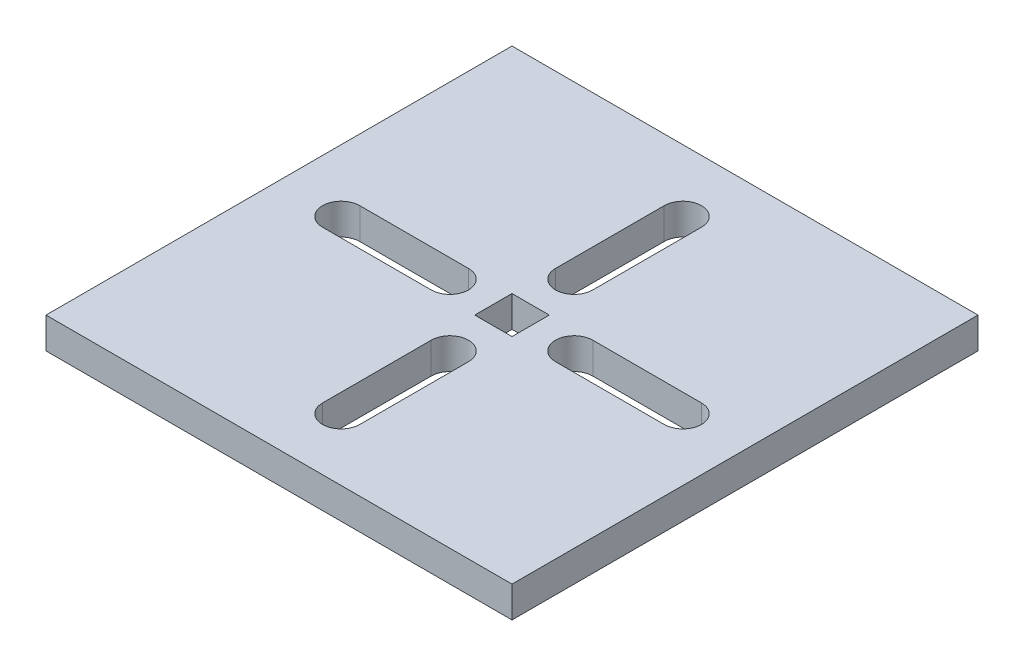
from build123d import *

# Parameters (mm, degrees)
SKETCH1_W           = 150
SKETCH1_H           = 150
BOSS_EXTRUDE1_DEPTH = 10
SKETCH3_W           = 12
SKETCH3_H           = 12
CUT_EXTRUDE2_DEPTH  = 107.536378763
CUT_EXTRUDE1_DEPTH  = 107.536378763
CIRPATTERN1_COUNT   = 4


with BuildPart() as part:
    # Sketch1 → Boss-Extrude1 (new body)
    with BuildSketch(Plane(origin=(0, 0, 0), x_dir=(1, 0, 0), z_dir=(0, 1, 0))):
        Rectangle(SKETCH1_W, SKETCH1_H)
    extrude(amount=BOSS_EXTRUDE1_DEPTH)

    # Sketch3 → Cut-Extrude2 (cut, through all)
    with BuildSketch(Plane(origin=(0, 10, 0), x_dir=(1, 0, 0), z_dir=(0, 1, 0))):
        Rectangle(SKETCH3_W, SKETCH3_H)
    extrude(amount=-CUT_EXTRUDE2_DEPTH, mode=Mode.SUBTRACT)

    # Sketch2 → Cut-Extrude1 (cut, through all)
    with BuildSketch(Plane(origin=(0, 10, 0), x_dir=(1, 0, 0), z_dir=(0, 1, 0))):
        with BuildLine():
            Line((20, 6), (55, 6))
            ThreePointArc((55, 6), (61, 0), (55, -6))
            Line((55, -6), (20, -6))
            ThreePointArc((20, -6), (14, 0), (20, 6))
        make_face()
    cut_extrude1 = extrude(amount=-CUT_EXTRUDE1_DEPTH, mode=Mode.SUBTRACT)

    # CirPattern1: Cut-Extrude1 ×4 about axis
    cirpattern1_axis = Axis((0, 0, 0), (0, 1, 0))
    for i in range(1, CIRPATTERN1_COUNT):
        add(cut_extrude1.rotate(cirpattern1_axis, i * 360 / CIRPATTERN1_COUNT), mode=Mode.SUBTRACT)


solid = part.part
